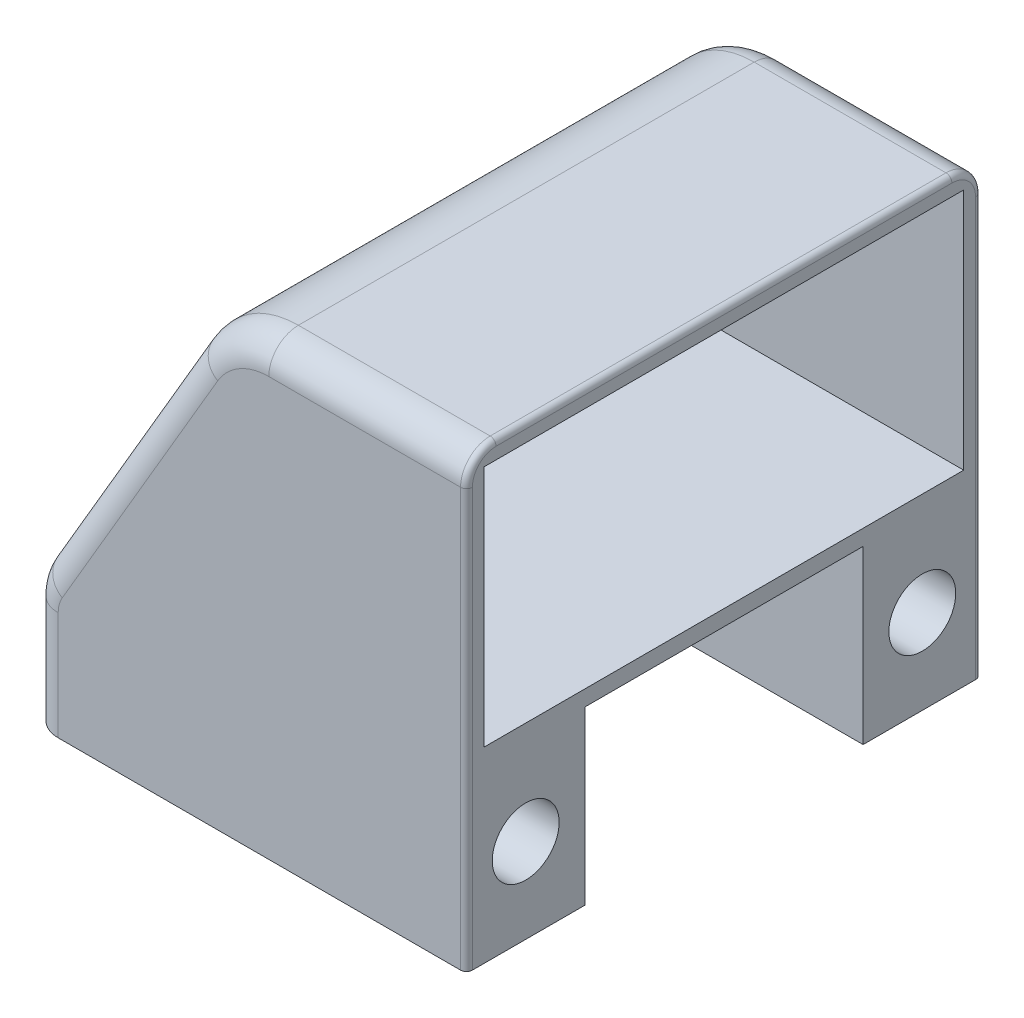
ISO-10303-21;
HEADER;
FILE_DESCRIPTION(('STEP AP214'),'2;1');
FILE_NAME('part.step','',(''),(''),'','','');
FILE_SCHEMA(('AUTOMOTIVE_DESIGN { 1 0 10303 214 1 1 1 1 }'));
ENDSEC;
DATA;
#1=APPLICATION_CONTEXT('core data for automotive mechanical design processes');
#2=APPLICATION_PROTOCOL_DEFINITION('international standard','automotive_design',2000,#1);
#3=PRODUCT_CONTEXT('',#1,'mechanical');
#4=PRODUCT('Part','Part','',(#3));
#5=PRODUCT_RELATED_PRODUCT_CATEGORY('part','',(#4));
#6=PRODUCT_DEFINITION_FORMATION('','',#4);
#7=PRODUCT_DEFINITION_CONTEXT('part definition',#1,'design');
#8=PRODUCT_DEFINITION('design','',#6,#7);
#9=PRODUCT_DEFINITION_SHAPE('','',#8);
#10=(LENGTH_UNIT() NAMED_UNIT(*) SI_UNIT(.MILLI.,.METRE.));
#11=(NAMED_UNIT(*) PLANE_ANGLE_UNIT() SI_UNIT($,.RADIAN.));
#12=(NAMED_UNIT(*) SI_UNIT($,.STERADIAN.) SOLID_ANGLE_UNIT());
#13=UNCERTAINTY_MEASURE_WITH_UNIT(LENGTH_MEASURE(1.E-05),#10,'distance_accuracy_value','');
#14=(GEOMETRIC_REPRESENTATION_CONTEXT(3) GLOBAL_UNCERTAINTY_ASSIGNED_CONTEXT((#13)) GLOBAL_UNIT_ASSIGNED_CONTEXT((#10,
#11,#12)) REPRESENTATION_CONTEXT('',''));
#15=CARTESIAN_POINT('',(0.,0.,0.));
#16=DIRECTION('',(0.,0.,1.));
#17=DIRECTION('',(1.,0.,0.));
#18=AXIS2_PLACEMENT_3D('',#15,#16,#17);
#19=CARTESIAN_POINT('',(0.,0.,87.));
#20=DIRECTION('',(-1.,0.,0.));
#21=DIRECTION('',(0.,0.,1.));
#22=AXIS2_PLACEMENT_3D('',#19,#20,#21);
#23=PLANE('',#22);
#24=CARTESIAN_POINT('',(0.,-14.33,10.));
#25=DIRECTION('',(1.,0.,0.));
#26=DIRECTION('',(0.,0.,-1.));
#27=AXIS2_PLACEMENT_3D('',#24,#25,#26);
#28=CIRCLE('',#27,5.65);
#29=CARTESIAN_POINT('',(0.,-14.33,4.35));
#30=VERTEX_POINT('',#29);
#31=EDGE_CURVE('E385',#30,#30,#28,.T.);
#32=ORIENTED_EDGE('',*,*,#31,.F.);
#33=EDGE_LOOP('',(#32));
#34=FACE_BOUND('',#33,.T.);
#35=CARTESIAN_POINT('',(0.,-14.33,77.));
#36=DIRECTION('',(1.,0.,0.));
#37=DIRECTION('',(0.,0.,-1.));
#38=AXIS2_PLACEMENT_3D('',#35,#36,#37);
#39=CIRCLE('',#38,5.65000000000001);
#40=CARTESIAN_POINT('',(0.,-14.33,71.35));
#41=VERTEX_POINT('',#40);
#42=EDGE_CURVE('E245',#41,#41,#39,.T.);
#43=ORIENTED_EDGE('',*,*,#42,.F.);
#44=EDGE_LOOP('',(#43));
#45=FACE_BOUND('',#44,.T.);
#46=DIRECTION('',(0.,0.,1.));
#47=VECTOR('',#46,1.);
#48=CARTESIAN_POINT('',(0.,-28.65,-79.3301992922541));
#49=LINE('',#48,#47);
#50=CARTESIAN_POINT('',(0.,-28.65,1.));
#51=VERTEX_POINT('',#50);
#52=CARTESIAN_POINT('',(0.,-28.65,20.));
#53=VERTEX_POINT('',#52);
#54=EDGE_CURVE('E276',#51,#53,#49,.T.);
#55=ORIENTED_EDGE('',*,*,#54,.F.);
#56=DIRECTION('',(0.,1.,0.));
#57=VECTOR('',#56,1.);
#58=CARTESIAN_POINT('',(0.,0.,1.));
#59=LINE('',#58,#57);
#60=CARTESIAN_POINT('',(0.,42.,1.));
#61=VERTEX_POINT('',#60);
#62=EDGE_CURVE('E413',#51,#61,#59,.T.);
#63=ORIENTED_EDGE('',*,*,#62,.T.);
#64=CARTESIAN_POINT('',(0.,42.,5.));
#65=DIRECTION('',(-1.,0.,0.));
#66=DIRECTION('',(0.,0.,1.));
#67=AXIS2_PLACEMENT_3D('',#64,#65,#66);
#68=CIRCLE('',#67,4.);
#69=CARTESIAN_POINT('',(0.,46.,5.));
#70=VERTEX_POINT('',#69);
#71=EDGE_CURVE('E411',#61,#70,#68,.F.);
#72=ORIENTED_EDGE('',*,*,#71,.T.);
#73=DIRECTION('',(0.,0.,-1.));
#74=VECTOR('',#73,1.);
#75=CARTESIAN_POINT('',(0.,46.,87.));
#76=LINE('',#75,#74);
#77=CARTESIAN_POINT('',(0.,46.,82.));
#78=VERTEX_POINT('',#77);
#79=EDGE_CURVE('E409',#70,#78,#76,.F.);
#80=ORIENTED_EDGE('',*,*,#79,.T.);
#81=CARTESIAN_POINT('',(0.,42.,82.));
#82=DIRECTION('',(-1.,0.,0.));
#83=DIRECTION('',(0.,0.,1.));
#84=AXIS2_PLACEMENT_3D('',#81,#82,#83);
#85=CIRCLE('',#84,4.);
#86=CARTESIAN_POINT('',(0.,42.,86.));
#87=VERTEX_POINT('',#86);
#88=EDGE_CURVE('E407',#78,#87,#85,.F.);
#89=ORIENTED_EDGE('',*,*,#88,.T.);
#90=DIRECTION('',(0.,1.,0.));
#91=VECTOR('',#90,1.);
#92=CARTESIAN_POINT('',(0.,-28.65,86.));
#93=LINE('',#92,#91);
#94=CARTESIAN_POINT('',(0.,-28.65,86.));
#95=VERTEX_POINT('',#94);
#96=EDGE_CURVE('E405',#87,#95,#93,.F.);
#97=ORIENTED_EDGE('',*,*,#96,.T.);
#98=CARTESIAN_POINT('',(0.,-28.65,67.));
#99=VERTEX_POINT('',#98);
#100=EDGE_CURVE('E280',#99,#95,#49,.T.);
#101=ORIENTED_EDGE('',*,*,#100,.F.);
#102=DIRECTION('',(0.,-1.,0.));
#103=VECTOR('',#102,1.);
#104=CARTESIAN_POINT('',(0.,-28.65,67.));
#105=LINE('',#104,#103);
#106=CARTESIAN_POINT('',(0.,0.35,67.));
#107=VERTEX_POINT('',#106);
#108=EDGE_CURVE('E253',#107,#99,#105,.T.);
#109=ORIENTED_EDGE('',*,*,#108,.F.);
#110=DIRECTION('',(0.,0.,1.));
#111=VECTOR('',#110,1.);
#112=CARTESIAN_POINT('',(0.,0.35,67.));
#113=LINE('',#112,#111);
#114=CARTESIAN_POINT('',(0.,0.35,20.));
#115=VERTEX_POINT('',#114);
#116=EDGE_CURVE('E258',#115,#107,#113,.T.);
#117=ORIENTED_EDGE('',*,*,#116,.F.);
#118=DIRECTION('',(0.,1.,0.));
#119=VECTOR('',#118,1.);
#120=CARTESIAN_POINT('',(0.,-28.65,20.));
#121=LINE('',#120,#119);
#122=EDGE_CURVE('E221',#53,#115,#121,.T.);
#123=ORIENTED_EDGE('',*,*,#122,.F.);
#124=EDGE_LOOP('',(#55,#63,#72,#80,#89,#97,#101,#109,#117,#123));
#125=FACE_BOUND('',#124,.T.);
#126=DIRECTION('',(0.,1.,0.));
#127=VECTOR('',#126,1.);
#128=CARTESIAN_POINT('',(0.,0.,3.));
#129=LINE('',#128,#127);
#130=CARTESIAN_POINT('',(0.,3.,3.));
#131=VERTEX_POINT('',#130);
#132=CARTESIAN_POINT('',(0.,44.,3.));
#133=VERTEX_POINT('',#132);
#134=EDGE_CURVE('E275',#131,#133,#129,.T.);
#135=ORIENTED_EDGE('',*,*,#134,.F.);
#136=DIRECTION('',(0.,0.,-1.));
#137=VECTOR('',#136,1.);
#138=CARTESIAN_POINT('',(0.,3.,87.));
#139=LINE('',#138,#137);
#140=CARTESIAN_POINT('',(0.,3.,84.));
#141=VERTEX_POINT('',#140);
#142=EDGE_CURVE('E298',#141,#131,#139,.T.);
#143=ORIENTED_EDGE('',*,*,#142,.F.);
#144=DIRECTION('',(0.,1.,0.));
#145=VECTOR('',#144,1.);
#146=CARTESIAN_POINT('',(0.,0.,84.));
#147=LINE('',#146,#145);
#148=CARTESIAN_POINT('',(0.,44.,84.));
#149=VERTEX_POINT('',#148);
#150=EDGE_CURVE('E291',#141,#149,#147,.T.);
#151=ORIENTED_EDGE('',*,*,#150,.T.);
#152=DIRECTION('',(0.,0.,-1.));
#153=VECTOR('',#152,1.);
#154=CARTESIAN_POINT('',(0.,44.,87.));
#155=LINE('',#154,#153);
#156=EDGE_CURVE('E297',#149,#133,#155,.T.);
#157=ORIENTED_EDGE('',*,*,#156,.T.);
#158=EDGE_LOOP('',(#135,#143,#151,#157));
#159=FACE_BOUND('',#158,.T.);
#160=ADVANCED_FACE('F33',(#34,#45,#125,#159),#23,.F.);
#161=CARTESIAN_POINT('',(0.,47.,87.));
#162=DIRECTION('',(0.,-1.,0.));
#163=DIRECTION('',(1.,0.,0.));
#164=AXIS2_PLACEMENT_3D('',#161,#162,#163);
#165=PLANE('',#164);
#166=DIRECTION('',(-1.,0.,0.));
#167=VECTOR('',#166,1.);
#168=CARTESIAN_POINT('',(0.,47.,82.));
#169=LINE('',#168,#167);
#170=CARTESIAN_POINT('',(-33.3976247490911,47.,82.));
#171=VERTEX_POINT('',#170);
#172=CARTESIAN_POINT('',(-1.,47.,82.));
#173=VERTEX_POINT('',#172);
#174=EDGE_CURVE('E324',#171,#173,#169,.F.);
#175=ORIENTED_EDGE('',*,*,#174,.T.);
#176=DIRECTION('',(0.,0.,-1.));
#177=VECTOR('',#176,1.);
#178=CARTESIAN_POINT('',(-1.,47.,87.));
#179=LINE('',#178,#177);
#180=CARTESIAN_POINT('',(-1.,47.,5.));
#181=VERTEX_POINT('',#180);
#182=EDGE_CURVE('E424',#173,#181,#179,.T.);
#183=ORIENTED_EDGE('',*,*,#182,.T.);
#184=DIRECTION('',(-1.,0.,0.));
#185=VECTOR('',#184,1.);
#186=CARTESIAN_POINT('',(0.,47.,5.));
#187=LINE('',#186,#185);
#188=CARTESIAN_POINT('',(-33.3976247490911,47.,4.99999999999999));
#189=VERTEX_POINT('',#188);
#190=EDGE_CURVE('E326',#181,#189,#187,.T.);
#191=ORIENTED_EDGE('',*,*,#190,.T.);
#192=DIRECTION('',(0.,0.,-1.));
#193=VECTOR('',#192,1.);
#194=CARTESIAN_POINT('',(-33.3976247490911,47.,87.));
#195=LINE('',#194,#193);
#196=EDGE_CURVE('E315',#189,#171,#195,.F.);
#197=ORIENTED_EDGE('',*,*,#196,.T.);
#198=EDGE_LOOP('',(#175,#183,#191,#197));
#199=FACE_BOUND('',#198,.T.);
#200=ADVANCED_FACE('F492',(#199),#165,.F.);
#201=CARTESIAN_POINT('',(-42.,47.,87.));
#202=DIRECTION('',(0.863112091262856,-0.505012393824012,0.));
#203=DIRECTION('',(0.505012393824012,0.863112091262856,0.));
#204=AXIS2_PLACEMENT_3D('',#201,#202,#203);
#205=PLANE('',#204);
#206=DIRECTION('',(0.,0.,-1.));
#207=VECTOR('',#206,1.);
#208=CARTESIAN_POINT('',(-46.3443061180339,39.5751859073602,87.));
#209=LINE('',#208,#207);
#210=CARTESIAN_POINT('',(-46.3443061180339,39.5751859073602,82.));
#211=VERTEX_POINT('',#210);
#212=CARTESIAN_POINT('',(-46.3443061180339,39.5751859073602,5.));
#213=VERTEX_POINT('',#212);
#214=EDGE_CURVE('E306',#211,#213,#209,.T.);
#215=ORIENTED_EDGE('',*,*,#214,.T.);
#216=DIRECTION('',(-0.505012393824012,-0.863112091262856,0.));
#217=VECTOR('',#216,1.);
#218=CARTESIAN_POINT('',(-42.,47.,5.));
#219=LINE('',#218,#217);
#220=CARTESIAN_POINT('',(-72.6071847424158,-5.31046119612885,5.));
#221=VERTEX_POINT('',#220);
#222=EDGE_CURVE('E345',#213,#221,#219,.T.);
#223=ORIENTED_EDGE('',*,*,#222,.T.);
#224=DIRECTION('',(0.,0.,1.));
#225=VECTOR('',#224,1.);
#226=CARTESIAN_POINT('',(-72.6071847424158,-5.31046119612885,87.));
#227=LINE('',#226,#225);
#228=CARTESIAN_POINT('',(-72.6071847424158,-5.31046119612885,82.));
#229=VERTEX_POINT('',#228);
#230=EDGE_CURVE('E318',#221,#229,#227,.T.);
#231=ORIENTED_EDGE('',*,*,#230,.T.);
#232=DIRECTION('',(-0.505012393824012,-0.863112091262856,0.));
#233=VECTOR('',#232,1.);
#234=CARTESIAN_POINT('',(-46.3443061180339,39.5751859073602,82.));
#235=LINE('',#234,#233);
#236=EDGE_CURVE('E343',#229,#211,#235,.F.);
#237=ORIENTED_EDGE('',*,*,#236,.T.);
#238=EDGE_LOOP('',(#215,#223,#231,#237));
#239=FACE_BOUND('',#238,.T.);
#240=ADVANCED_FACE('F534',(#239),#205,.F.);
#241=CARTESIAN_POINT('',(0.,47.,87.));
#242=DIRECTION('',(0.,0.,1.));
#243=DIRECTION('',(1.,0.,0.));
#244=AXIS2_PLACEMENT_3D('',#241,#242,#243);
#245=PLANE('',#244);
#246=DIRECTION('',(1.,0.,0.));
#247=VECTOR('',#246,1.);
#248=CARTESIAN_POINT('',(0.,-28.65,87.));
#249=LINE('',#248,#247);
#250=CARTESIAN_POINT('',(-68.9760638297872,-28.65,87.));
#251=VERTEX_POINT('',#250);
#252=CARTESIAN_POINT('',(-1.,-28.65,87.));
#253=VERTEX_POINT('',#252);
#254=EDGE_CURVE('E268',#251,#253,#249,.T.);
#255=ORIENTED_EDGE('',*,*,#254,.T.);
#256=DIRECTION('',(0.,1.,0.));
#257=VECTOR('',#256,1.);
#258=CARTESIAN_POINT('',(-1.,42.,87.));
#259=LINE('',#258,#257);
#260=CARTESIAN_POINT('',(-1.,42.,87.));
#261=VERTEX_POINT('',#260);
#262=EDGE_CURVE('E11',#253,#261,#259,.T.);
#263=ORIENTED_EDGE('',*,*,#262,.T.);
#264=DIRECTION('',(-1.,0.,0.));
#265=VECTOR('',#264,1.);
#266=CARTESIAN_POINT('',(-33.3976247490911,42.,87.));
#267=LINE('',#266,#265);
#268=CARTESIAN_POINT('',(-33.3976247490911,42.,87.));
#269=VERTEX_POINT('',#268);
#270=EDGE_CURVE('E360',#261,#269,#267,.T.);
#271=ORIENTED_EDGE('',*,*,#270,.T.);
#272=CARTESIAN_POINT('',(-33.3976247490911,32.,87.));
#273=DIRECTION('',(0.,0.,1.));
#274=DIRECTION('',(1.,0.,0.));
#275=AXIS2_PLACEMENT_3D('',#272,#273,#274);
#276=CIRCLE('',#275,10.);
#277=CARTESIAN_POINT('',(-42.0287456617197,37.0501239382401,87.));
#278=VERTEX_POINT('',#277);
#279=EDGE_CURVE('E362',#269,#278,#276,.T.);
#280=ORIENTED_EDGE('',*,*,#279,.T.);
#281=DIRECTION('',(-0.505012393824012,-0.863112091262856,0.));
#282=VECTOR('',#281,1.);
#283=CARTESIAN_POINT('',(-68.2916242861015,-7.83552316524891,87.));
#284=LINE('',#283,#282);
#285=CARTESIAN_POINT('',(-68.2916242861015,-7.83552316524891,87.));
#286=VERTEX_POINT('',#285);
#287=EDGE_CURVE('E364',#278,#286,#284,.T.);
#288=ORIENTED_EDGE('',*,*,#287,.T.);
#289=CARTESIAN_POINT('',(-63.9760638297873,-10.360585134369,87.));
#290=DIRECTION('',(0.,0.,1.));
#291=DIRECTION('',(1.,0.,0.));
#292=AXIS2_PLACEMENT_3D('',#289,#290,#291);
#293=CIRCLE('',#292,5.);
#294=CARTESIAN_POINT('',(-68.9760638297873,-10.360585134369,87.));
#295=VERTEX_POINT('',#294);
#296=EDGE_CURVE('E366',#286,#295,#293,.T.);
#297=ORIENTED_EDGE('',*,*,#296,.T.);
#298=DIRECTION('',(0.,-1.,0.));
#299=VECTOR('',#298,1.);
#300=CARTESIAN_POINT('',(-68.9760638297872,47.,87.));
#301=LINE('',#300,#299);
#302=EDGE_CURVE('E368',#295,#251,#301,.T.);
#303=ORIENTED_EDGE('',*,*,#302,.T.);
#304=EDGE_LOOP('',(#255,#263,#271,#280,#288,#297,#303));
#305=FACE_BOUND('',#304,.T.);
#306=ADVANCED_FACE('F500',(#305),#245,.T.);
#307=CARTESIAN_POINT('',(0.,47.,0.));
#308=DIRECTION('',(0.,0.,1.));
#309=DIRECTION('',(1.,0.,0.));
#310=AXIS2_PLACEMENT_3D('',#307,#308,#309);
#311=PLANE('',#310);
#312=DIRECTION('',(-1.,0.,0.));
#313=VECTOR('',#312,1.);
#314=CARTESIAN_POINT('',(0.,42.,0.));
#315=LINE('',#314,#313);
#316=CARTESIAN_POINT('',(-33.3976247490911,42.,0.));
#317=VERTEX_POINT('',#316);
#318=CARTESIAN_POINT('',(-1.,42.,0.));
#319=VERTEX_POINT('',#318);
#320=EDGE_CURVE('E336',#317,#319,#315,.F.);
#321=ORIENTED_EDGE('',*,*,#320,.T.);
#322=DIRECTION('',(0.,1.,0.));
#323=VECTOR('',#322,1.);
#324=CARTESIAN_POINT('',(-1.,47.,0.));
#325=LINE('',#324,#323);
#326=CARTESIAN_POINT('',(-1.,-28.65,0.));
#327=VERTEX_POINT('',#326);
#328=EDGE_CURVE('E416',#319,#327,#325,.F.);
#329=ORIENTED_EDGE('',*,*,#328,.T.);
#330=DIRECTION('',(-1.,0.,0.));
#331=VECTOR('',#330,1.);
#332=CARTESIAN_POINT('',(0.,-28.65,0.));
#333=LINE('',#332,#331);
#334=CARTESIAN_POINT('',(-68.9760638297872,-28.65,0.));
#335=VERTEX_POINT('',#334);
#336=EDGE_CURVE('E273',#327,#335,#333,.T.);
#337=ORIENTED_EDGE('',*,*,#336,.T.);
#338=DIRECTION('',(0.,1.,0.));
#339=VECTOR('',#338,1.);
#340=CARTESIAN_POINT('',(-68.9760638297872,-10.360585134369,0.));
#341=LINE('',#340,#339);
#342=CARTESIAN_POINT('',(-68.9760638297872,-10.360585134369,0.));
#343=VERTEX_POINT('',#342);
#344=EDGE_CURVE('E328',#335,#343,#341,.T.);
#345=ORIENTED_EDGE('',*,*,#344,.T.);
#346=CARTESIAN_POINT('',(-63.9760638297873,-10.360585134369,0.));
#347=DIRECTION('',(0.,0.,1.));
#348=DIRECTION('',(1.,0.,0.));
#349=AXIS2_PLACEMENT_3D('',#346,#347,#348);
#350=CIRCLE('',#349,5.);
#351=CARTESIAN_POINT('',(-68.2916242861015,-7.8355231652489,0.));
#352=VERTEX_POINT('',#351);
#353=EDGE_CURVE('E330',#343,#352,#350,.F.);
#354=ORIENTED_EDGE('',*,*,#353,.T.);
#355=DIRECTION('',(-0.505012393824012,-0.863112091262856,0.));
#356=VECTOR('',#355,1.);
#357=CARTESIAN_POINT('',(-26.9728637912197,62.7819947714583,0.));
#358=LINE('',#357,#356);
#359=CARTESIAN_POINT('',(-42.0287456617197,37.0501239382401,0.));
#360=VERTEX_POINT('',#359);
#361=EDGE_CURVE('E332',#352,#360,#358,.F.);
#362=ORIENTED_EDGE('',*,*,#361,.T.);
#363=CARTESIAN_POINT('',(-33.3976247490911,32.,0.));
#364=DIRECTION('',(0.,0.,1.));
#365=DIRECTION('',(1.,0.,0.));
#366=AXIS2_PLACEMENT_3D('',#363,#364,#365);
#367=CIRCLE('',#366,10.);
#368=EDGE_CURVE('E334',#360,#317,#367,.F.);
#369=ORIENTED_EDGE('',*,*,#368,.T.);
#370=EDGE_LOOP('',(#321,#329,#337,#345,#354,#362,#369));
#371=FACE_BOUND('',#370,.T.);
#372=ADVANCED_FACE('F479',(#371),#311,.F.);
#373=CARTESIAN_POINT('',(0.,44.,87.));
#374=DIRECTION('',(0.,-1.,0.));
#375=DIRECTION('',(1.,0.,0.));
#376=AXIS2_PLACEMENT_3D('',#373,#374,#375);
#377=PLANE('',#376);
#378=DIRECTION('',(-1.,0.,0.));
#379=VECTOR('',#378,1.);
#380=CARTESIAN_POINT('',(0.,44.,84.));
#381=LINE('',#380,#379);
#382=CARTESIAN_POINT('',(-34.544608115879,44.,84.));
#383=VERTEX_POINT('',#382);
#384=EDGE_CURVE('E287',#149,#383,#381,.T.);
#385=ORIENTED_EDGE('',*,*,#384,.T.);
#386=DIRECTION('',(0.,0.,-1.));
#387=VECTOR('',#386,1.);
#388=CARTESIAN_POINT('',(-34.544608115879,44.,3.00000000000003));
#389=LINE('',#388,#387);
#390=CARTESIAN_POINT('',(-34.544608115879,44.,3.));
#391=VERTEX_POINT('',#390);
#392=EDGE_CURVE('E371',#383,#391,#389,.T.);
#393=ORIENTED_EDGE('',*,*,#392,.T.);
#394=DIRECTION('',(-1.,0.,0.));
#395=VECTOR('',#394,1.);
#396=CARTESIAN_POINT('',(0.,44.,3.));
#397=LINE('',#396,#395);
#398=EDGE_CURVE('E283',#133,#391,#397,.T.);
#399=ORIENTED_EDGE('',*,*,#398,.F.);
#400=ORIENTED_EDGE('',*,*,#156,.F.);
#401=EDGE_LOOP('',(#385,#393,#399,#400));
#402=FACE_BOUND('',#401,.T.);
#403=ADVANCED_FACE('F561',(#402),#377,.T.);
#404=CARTESIAN_POINT('',(-39.4106637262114,45.484962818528,87.));
#405=DIRECTION('',(0.863112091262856,-0.505012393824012,0.));
#406=DIRECTION('',(0.505012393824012,0.863112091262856,0.));
#407=AXIS2_PLACEMENT_3D('',#404,#405,#406);
#408=PLANE('',#407);
#409=DIRECTION('',(-0.505012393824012,-0.863112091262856,0.));
#410=VECTOR('',#409,1.);
#411=CARTESIAN_POINT('',(-39.4106637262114,45.484962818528,3.));
#412=LINE('',#411,#410);
#413=CARTESIAN_POINT('',(-43.1757290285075,39.0501239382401,3.));
#414=VERTEX_POINT('',#413);
#415=CARTESIAN_POINT('',(-64.2688866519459,2.99999999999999,3.));
#416=VERTEX_POINT('',#415);
#417=EDGE_CURVE('E286',#414,#416,#412,.T.);
#418=ORIENTED_EDGE('',*,*,#417,.F.);
#419=DIRECTION('',(0.,0.,-1.));
#420=VECTOR('',#419,1.);
#421=CARTESIAN_POINT('',(-43.1757290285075,39.0501239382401,84.));
#422=LINE('',#421,#420);
#423=CARTESIAN_POINT('',(-43.1757290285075,39.0501239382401,84.));
#424=VERTEX_POINT('',#423);
#425=EDGE_CURVE('E401',#414,#424,#422,.F.);
#426=ORIENTED_EDGE('',*,*,#425,.T.);
#427=DIRECTION('',(-0.505012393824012,-0.863112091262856,0.));
#428=VECTOR('',#427,1.);
#429=CARTESIAN_POINT('',(-39.4106637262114,45.484962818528,84.));
#430=LINE('',#429,#428);
#431=CARTESIAN_POINT('',(-64.2688866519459,2.99999999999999,84.));
#432=VERTEX_POINT('',#431);
#433=EDGE_CURVE('E290',#424,#432,#430,.T.);
#434=ORIENTED_EDGE('',*,*,#433,.T.);
#435=DIRECTION('',(0.,0.,-1.));
#436=VECTOR('',#435,1.);
#437=CARTESIAN_POINT('',(-64.2688866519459,2.99999999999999,87.));
#438=LINE('',#437,#436);
#439=EDGE_CURVE('E294',#432,#416,#438,.T.);
#440=ORIENTED_EDGE('',*,*,#439,.T.);
#441=EDGE_LOOP('',(#418,#426,#434,#440));
#442=FACE_BOUND('',#441,.T.);
#443=ADVANCED_FACE('F575',(#442),#408,.T.);
#444=CARTESIAN_POINT('',(0.,3.,87.));
#445=DIRECTION('',(0.,1.,0.));
#446=DIRECTION('',(-1.,0.,0.));
#447=AXIS2_PLACEMENT_3D('',#444,#445,#446);
#448=PLANE('',#447);
#449=DIRECTION('',(1.,0.,0.));
#450=VECTOR('',#449,1.);
#451=CARTESIAN_POINT('',(0.,3.,3.));
#452=LINE('',#451,#450);
#453=EDGE_CURVE('E293',#416,#131,#452,.T.);
#454=ORIENTED_EDGE('',*,*,#453,.F.);
#455=ORIENTED_EDGE('',*,*,#439,.F.);
#456=DIRECTION('',(1.,0.,0.));
#457=VECTOR('',#456,1.);
#458=CARTESIAN_POINT('',(0.,3.,84.));
#459=LINE('',#458,#457);
#460=EDGE_CURVE('E300',#432,#141,#459,.T.);
#461=ORIENTED_EDGE('',*,*,#460,.T.);
#462=ORIENTED_EDGE('',*,*,#142,.T.);
#463=EDGE_LOOP('',(#454,#455,#461,#462));
#464=FACE_BOUND('',#463,.T.);
#465=ADVANCED_FACE('F571',(#464),#448,.T.);
#466=CARTESIAN_POINT('',(0.,47.,84.));
#467=DIRECTION('',(0.,0.,1.));
#468=DIRECTION('',(1.,0.,0.));
#469=AXIS2_PLACEMENT_3D('',#466,#467,#468);
#470=PLANE('',#469);
#471=ORIENTED_EDGE('',*,*,#433,.F.);
#472=CARTESIAN_POINT('',(-34.544608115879,34.,84.));
#473=DIRECTION('',(0.,0.,1.));
#474=DIRECTION('',(1.,0.,0.));
#475=AXIS2_PLACEMENT_3D('',#472,#473,#474);
#476=CIRCLE('',#475,10.);
#477=EDGE_CURVE('E403',#424,#383,#476,.F.);
#478=ORIENTED_EDGE('',*,*,#477,.T.);
#479=ORIENTED_EDGE('',*,*,#384,.F.);
#480=ORIENTED_EDGE('',*,*,#150,.F.);
#481=ORIENTED_EDGE('',*,*,#460,.F.);
#482=EDGE_LOOP('',(#471,#478,#479,#480,#481));
#483=FACE_BOUND('',#482,.T.);
#484=ADVANCED_FACE('F567',(#483),#470,.F.);
#485=CARTESIAN_POINT('',(0.,47.,3.));
#486=DIRECTION('',(0.,0.,1.));
#487=DIRECTION('',(1.,0.,0.));
#488=AXIS2_PLACEMENT_3D('',#485,#486,#487);
#489=PLANE('',#488);
#490=ORIENTED_EDGE('',*,*,#398,.T.);
#491=CARTESIAN_POINT('',(-34.544608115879,34.,3.));
#492=DIRECTION('',(0.,0.,1.));
#493=DIRECTION('',(1.,0.,0.));
#494=AXIS2_PLACEMENT_3D('',#491,#492,#493);
#495=CIRCLE('',#494,10.);
#496=EDGE_CURVE('E399',#391,#414,#495,.T.);
#497=ORIENTED_EDGE('',*,*,#496,.T.);
#498=ORIENTED_EDGE('',*,*,#417,.T.);
#499=ORIENTED_EDGE('',*,*,#453,.T.);
#500=ORIENTED_EDGE('',*,*,#134,.T.);
#501=EDGE_LOOP('',(#490,#497,#498,#499,#500));
#502=FACE_BOUND('',#501,.T.);
#503=ADVANCED_FACE('F564',(#502),#489,.T.);
#504=CARTESIAN_POINT('',(0.,-28.65,-79.3301992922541));
#505=DIRECTION('',(0.,-1.,0.));
#506=DIRECTION('',(1.,0.,0.));
#507=AXIS2_PLACEMENT_3D('',#504,#505,#506);
#508=PLANE('',#507);
#509=ORIENTED_EDGE('',*,*,#336,.F.);
#510=CARTESIAN_POINT('',(-1.,-28.65,1.));
#511=DIRECTION('',(0.,-1.,0.));
#512=DIRECTION('',(1.,0.,0.));
#513=AXIS2_PLACEMENT_3D('',#510,#511,#512);
#514=CIRCLE('',#513,1.);
#515=EDGE_CURVE('E420',#327,#51,#514,.T.);
#516=ORIENTED_EDGE('',*,*,#515,.T.);
#517=ORIENTED_EDGE('',*,*,#54,.T.);
#518=DIRECTION('',(1.,0.,0.));
#519=VECTOR('',#518,1.);
#520=CARTESIAN_POINT('',(-49.5,-28.65,20.));
#521=LINE('',#520,#519);
#522=CARTESIAN_POINT('',(-49.5,-28.65,20.));
#523=VERTEX_POINT('',#522);
#524=EDGE_CURVE('E226',#523,#53,#521,.T.);
#525=ORIENTED_EDGE('',*,*,#524,.F.);
#526=DIRECTION('',(0.,0.,-1.));
#527=VECTOR('',#526,1.);
#528=CARTESIAN_POINT('',(-49.5,-28.65,67.));
#529=LINE('',#528,#527);
#530=CARTESIAN_POINT('',(-49.5,-28.65,67.));
#531=VERTEX_POINT('',#530);
#532=EDGE_CURVE('E257',#531,#523,#529,.T.);
#533=ORIENTED_EDGE('',*,*,#532,.F.);
#534=DIRECTION('',(1.,0.,0.));
#535=VECTOR('',#534,1.);
#536=CARTESIAN_POINT('',(-49.5,-28.65,67.));
#537=LINE('',#536,#535);
#538=EDGE_CURVE('E264',#531,#99,#537,.T.);
#539=ORIENTED_EDGE('',*,*,#538,.T.);
#540=ORIENTED_EDGE('',*,*,#100,.T.);
#541=CARTESIAN_POINT('',(-1.,-28.65,86.));
#542=DIRECTION('',(0.,-1.,0.));
#543=DIRECTION('',(1.,0.,0.));
#544=AXIS2_PLACEMENT_3D('',#541,#542,#543);
#545=CIRCLE('',#544,1.);
#546=EDGE_CURVE('E418',#95,#253,#545,.T.);
#547=ORIENTED_EDGE('',*,*,#546,.T.);
#548=ORIENTED_EDGE('',*,*,#254,.F.);
#549=CARTESIAN_POINT('',(-68.9760638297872,-28.65,82.));
#550=DIRECTION('',(0.,-1.,0.));
#551=DIRECTION('',(1.,0.,0.));
#552=AXIS2_PLACEMENT_3D('',#549,#550,#551);
#553=CIRCLE('',#552,5.);
#554=CARTESIAN_POINT('',(-73.9760638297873,-28.65,82.));
#555=VERTEX_POINT('',#554);
#556=EDGE_CURVE('E355',#251,#555,#553,.T.);
#557=ORIENTED_EDGE('',*,*,#556,.T.);
#558=DIRECTION('',(0.,0.,1.));
#559=VECTOR('',#558,1.);
#560=CARTESIAN_POINT('',(-73.9760638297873,-28.65,-79.3301992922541));
#561=LINE('',#560,#559);
#562=CARTESIAN_POINT('',(-73.9760638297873,-28.65,5.));
#563=VERTEX_POINT('',#562);
#564=EDGE_CURVE('E278',#563,#555,#561,.T.);
#565=ORIENTED_EDGE('',*,*,#564,.F.);
#566=CARTESIAN_POINT('',(-68.9760638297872,-28.65,5.));
#567=DIRECTION('',(0.,-1.,0.));
#568=DIRECTION('',(1.,0.,0.));
#569=AXIS2_PLACEMENT_3D('',#566,#567,#568);
#570=CIRCLE('',#569,5.);
#571=EDGE_CURVE('E357',#563,#335,#570,.T.);
#572=ORIENTED_EDGE('',*,*,#571,.T.);
#573=EDGE_LOOP('',(#509,#516,#517,#525,#533,#539,#540,#547,#548,#557,#565,#572));
#574=FACE_BOUND('',#573,.T.);
#575=ADVANCED_FACE('F453',(#574),#508,.T.);
#576=CARTESIAN_POINT('',(-73.9760638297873,-28.65,-79.3301992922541));
#577=DIRECTION('',(-1.,0.,0.));
#578=DIRECTION('',(0.,0.,1.));
#579=AXIS2_PLACEMENT_3D('',#576,#577,#578);
#580=PLANE('',#579);
#581=DIRECTION('',(0.,0.,1.));
#582=VECTOR('',#581,1.);
#583=CARTESIAN_POINT('',(-73.9760638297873,-10.360585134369,0.));
#584=LINE('',#583,#582);
#585=CARTESIAN_POINT('',(-73.9760638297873,-10.360585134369,82.));
#586=VERTEX_POINT('',#585);
#587=CARTESIAN_POINT('',(-73.9760638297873,-10.360585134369,5.));
#588=VERTEX_POINT('',#587);
#589=EDGE_CURVE('E321',#586,#588,#584,.F.);
#590=ORIENTED_EDGE('',*,*,#589,.T.);
#591=DIRECTION('',(0.,1.,0.));
#592=VECTOR('',#591,1.);
#593=CARTESIAN_POINT('',(-73.9760638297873,-28.65,5.));
#594=LINE('',#593,#592);
#595=EDGE_CURVE('E353',#588,#563,#594,.F.);
#596=ORIENTED_EDGE('',*,*,#595,.T.);
#597=ORIENTED_EDGE('',*,*,#564,.T.);
#598=DIRECTION('',(0.,-1.,0.));
#599=VECTOR('',#598,1.);
#600=CARTESIAN_POINT('',(-73.9760638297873,-28.65,82.));
#601=LINE('',#600,#599);
#602=EDGE_CURVE('E351',#555,#586,#601,.F.);
#603=ORIENTED_EDGE('',*,*,#602,.T.);
#604=EDGE_LOOP('',(#590,#596,#597,#603));
#605=FACE_BOUND('',#604,.T.);
#606=ADVANCED_FACE('F517',(#605),#580,.T.);
#607=CARTESIAN_POINT('',(-49.5,-28.65,67.));
#608=DIRECTION('',(0.,0.,1.));
#609=DIRECTION('',(1.,0.,0.));
#610=AXIS2_PLACEMENT_3D('',#607,#608,#609);
#611=PLANE('',#610);
#612=ORIENTED_EDGE('',*,*,#108,.T.);
#613=ORIENTED_EDGE('',*,*,#538,.F.);
#614=DIRECTION('',(0.,-1.,0.));
#615=VECTOR('',#614,1.);
#616=CARTESIAN_POINT('',(-49.5,-28.65,67.));
#617=LINE('',#616,#615);
#618=CARTESIAN_POINT('',(-49.5,-25.65,67.));
#619=VERTEX_POINT('',#618);
#620=EDGE_CURVE('E255',#619,#531,#617,.T.);
#621=ORIENTED_EDGE('',*,*,#620,.F.);
#622=DIRECTION('',(1.,0.,0.));
#623=VECTOR('',#622,1.);
#624=CARTESIAN_POINT('',(-67.,-25.65,67.));
#625=LINE('',#624,#623);
#626=CARTESIAN_POINT('',(-67.,-25.65,67.));
#627=VERTEX_POINT('',#626);
#628=EDGE_CURVE('E249',#627,#619,#625,.T.);
#629=ORIENTED_EDGE('',*,*,#628,.F.);
#630=DIRECTION('',(0.,-1.,0.));
#631=VECTOR('',#630,1.);
#632=CARTESIAN_POINT('',(-67.,0.349999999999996,67.));
#633=LINE('',#632,#631);
#634=CARTESIAN_POINT('',(-67.,0.349999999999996,67.));
#635=VERTEX_POINT('',#634);
#636=EDGE_CURVE('E234',#635,#627,#633,.T.);
#637=ORIENTED_EDGE('',*,*,#636,.F.);
#638=DIRECTION('',(1.,0.,0.));
#639=VECTOR('',#638,1.);
#640=CARTESIAN_POINT('',(-49.5,0.35,67.));
#641=LINE('',#640,#639);
#642=EDGE_CURVE('E225',#635,#107,#641,.T.);
#643=ORIENTED_EDGE('',*,*,#642,.T.);
#644=EDGE_LOOP('',(#612,#613,#621,#629,#637,#643));
#645=FACE_BOUND('',#644,.T.);
#646=ADVANCED_FACE('F460',(#645),#611,.F.);
#647=CARTESIAN_POINT('',(-49.5,0.35,67.));
#648=DIRECTION('',(0.,1.,0.));
#649=DIRECTION('',(0.,0.,1.));
#650=AXIS2_PLACEMENT_3D('',#647,#648,#649);
#651=PLANE('',#650);
#652=ORIENTED_EDGE('',*,*,#116,.T.);
#653=ORIENTED_EDGE('',*,*,#642,.F.);
#654=DIRECTION('',(0.,0.,1.));
#655=VECTOR('',#654,1.);
#656=CARTESIAN_POINT('',(-67.,0.349999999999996,20.));
#657=LINE('',#656,#655);
#658=CARTESIAN_POINT('',(-67.,0.349999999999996,20.));
#659=VERTEX_POINT('',#658);
#660=EDGE_CURVE('E229',#659,#635,#657,.T.);
#661=ORIENTED_EDGE('',*,*,#660,.F.);
#662=DIRECTION('',(1.,0.,0.));
#663=VECTOR('',#662,1.);
#664=CARTESIAN_POINT('',(-49.5,0.35,20.));
#665=LINE('',#664,#663);
#666=EDGE_CURVE('E213',#659,#115,#665,.T.);
#667=ORIENTED_EDGE('',*,*,#666,.T.);
#668=EDGE_LOOP('',(#652,#653,#661,#667));
#669=FACE_BOUND('',#668,.T.);
#670=ADVANCED_FACE('F230',(#669),#651,.F.);
#671=CARTESIAN_POINT('',(-49.5,-28.65,20.));
#672=DIRECTION('',(0.,0.,-1.));
#673=DIRECTION('',(-1.,0.,0.));
#674=AXIS2_PLACEMENT_3D('',#671,#672,#673);
#675=PLANE('',#674);
#676=ORIENTED_EDGE('',*,*,#122,.T.);
#677=ORIENTED_EDGE('',*,*,#666,.F.);
#678=DIRECTION('',(0.,1.,0.));
#679=VECTOR('',#678,1.);
#680=CARTESIAN_POINT('',(-67.,0.349999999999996,20.));
#681=LINE('',#680,#679);
#682=CARTESIAN_POINT('',(-67.,-25.65,20.));
#683=VERTEX_POINT('',#682);
#684=EDGE_CURVE('E217',#683,#659,#681,.T.);
#685=ORIENTED_EDGE('',*,*,#684,.F.);
#686=DIRECTION('',(1.,0.,0.));
#687=VECTOR('',#686,1.);
#688=CARTESIAN_POINT('',(-67.,-25.65,20.));
#689=LINE('',#688,#687);
#690=CARTESIAN_POINT('',(-49.5,-25.65,20.));
#691=VERTEX_POINT('',#690);
#692=EDGE_CURVE('E251',#683,#691,#689,.T.);
#693=ORIENTED_EDGE('',*,*,#692,.T.);
#694=DIRECTION('',(0.,1.,0.));
#695=VECTOR('',#694,1.);
#696=CARTESIAN_POINT('',(-49.5,-28.65,20.));
#697=LINE('',#696,#695);
#698=EDGE_CURVE('E261',#523,#691,#697,.T.);
#699=ORIENTED_EDGE('',*,*,#698,.F.);
#700=ORIENTED_EDGE('',*,*,#524,.T.);
#701=EDGE_LOOP('',(#676,#677,#685,#693,#699,#700));
#702=FACE_BOUND('',#701,.T.);
#703=ADVANCED_FACE('F215',(#702),#675,.F.);
#704=CARTESIAN_POINT('',(-49.5,0.35,67.));
#705=DIRECTION('',(-1.,0.,0.));
#706=DIRECTION('',(0.,0.,1.));
#707=AXIS2_PLACEMENT_3D('',#704,#705,#706);
#708=PLANE('',#707);
#709=ORIENTED_EDGE('',*,*,#698,.T.);
#710=DIRECTION('',(0.,0.,-1.));
#711=VECTOR('',#710,1.);
#712=CARTESIAN_POINT('',(-49.5,-25.65,20.));
#713=LINE('',#712,#711);
#714=EDGE_CURVE('E239',#619,#691,#713,.T.);
#715=ORIENTED_EDGE('',*,*,#714,.F.);
#716=ORIENTED_EDGE('',*,*,#620,.T.);
#717=ORIENTED_EDGE('',*,*,#532,.T.);
#718=EDGE_LOOP('',(#709,#715,#716,#717));
#719=FACE_BOUND('',#718,.T.);
#720=ADVANCED_FACE('F591',(#719),#708,.F.);
#721=CARTESIAN_POINT('',(-67.,-25.65,20.));
#722=DIRECTION('',(0.,-1.,0.));
#723=DIRECTION('',(0.,0.,-1.));
#724=AXIS2_PLACEMENT_3D('',#721,#722,#723);
#725=PLANE('',#724);
#726=ORIENTED_EDGE('',*,*,#714,.T.);
#727=ORIENTED_EDGE('',*,*,#692,.F.);
#728=DIRECTION('',(0.,0.,-1.));
#729=VECTOR('',#728,1.);
#730=CARTESIAN_POINT('',(-67.,-25.65,20.));
#731=LINE('',#730,#729);
#732=EDGE_CURVE('E238',#627,#683,#731,.T.);
#733=ORIENTED_EDGE('',*,*,#732,.F.);
#734=ORIENTED_EDGE('',*,*,#628,.T.);
#735=EDGE_LOOP('',(#726,#727,#733,#734));
#736=FACE_BOUND('',#735,.T.);
#737=ADVANCED_FACE('F596',(#736),#725,.F.);
#738=CARTESIAN_POINT('',(-67.,-25.65,20.));
#739=DIRECTION('',(-1.,0.,0.));
#740=DIRECTION('',(0.,0.,1.));
#741=AXIS2_PLACEMENT_3D('',#738,#739,#740);
#742=PLANE('',#741);
#743=ORIENTED_EDGE('',*,*,#684,.T.);
#744=ORIENTED_EDGE('',*,*,#660,.T.);
#745=ORIENTED_EDGE('',*,*,#636,.T.);
#746=ORIENTED_EDGE('',*,*,#732,.T.);
#747=EDGE_LOOP('',(#743,#744,#745,#746));
#748=FACE_BOUND('',#747,.T.);
#749=ADVANCED_FACE('F236',(#748),#742,.F.);
#750=CARTESIAN_POINT('',(-66.4,-14.33,77.));
#751=DIRECTION('',(1.,0.,0.));
#752=DIRECTION('',(0.,0.,-1.));
#753=AXIS2_PLACEMENT_3D('',#750,#751,#752);
#754=CYLINDRICAL_SURFACE('',#753,5.65000000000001);
#755=CARTESIAN_POINT('',(-66.4,-14.33,77.));
#756=DIRECTION('',(1.,0.,0.));
#757=DIRECTION('',(0.,0.,-1.));
#758=AXIS2_PLACEMENT_3D('',#755,#756,#757);
#759=CIRCLE('',#758,5.65000000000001);
#760=CARTESIAN_POINT('',(-66.4,-14.33,71.35));
#761=VERTEX_POINT('',#760);
#762=EDGE_CURVE('E242',#761,#761,#759,.T.);
#763=CARTESIAN_POINT('',(-66.4,-14.33,71.35));
#764=CARTESIAN_POINT('',(-65.7083333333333,-14.33,71.35));
#765=CARTESIAN_POINT('',(-65.0166666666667,-14.33,71.35));
#766=CARTESIAN_POINT('',(-63.6333333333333,-14.33,71.35));
#767=CARTESIAN_POINT('',(-62.9416666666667,-14.33,71.35));
#768=CARTESIAN_POINT('',(-61.5583333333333,-14.33,71.35));
#769=CARTESIAN_POINT('',(-60.8666666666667,-14.33,71.35));
#770=CARTESIAN_POINT('',(-59.4833333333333,-14.33,71.35));
#771=CARTESIAN_POINT('',(-58.7916666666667,-14.33,71.35));
#772=CARTESIAN_POINT('',(-57.4083333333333,-14.33,71.35));
#773=CARTESIAN_POINT('',(-56.7166666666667,-14.33,71.35));
#774=CARTESIAN_POINT('',(-55.3333333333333,-14.33,71.35));
#775=CARTESIAN_POINT('',(-54.6416666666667,-14.33,71.35));
#776=CARTESIAN_POINT('',(-53.2583333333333,-14.33,71.35));
#777=CARTESIAN_POINT('',(-52.5666666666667,-14.33,71.35));
#778=CARTESIAN_POINT('',(-51.1833333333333,-14.33,71.35));
#779=CARTESIAN_POINT('',(-50.4916666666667,-14.33,71.35));
#780=CARTESIAN_POINT('',(-49.1083333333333,-14.33,71.35));
#781=CARTESIAN_POINT('',(-48.4166666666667,-14.33,71.35));
#782=CARTESIAN_POINT('',(-47.0333333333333,-14.33,71.35));
#783=CARTESIAN_POINT('',(-46.3416666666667,-14.33,71.35));
#784=CARTESIAN_POINT('',(-44.9583333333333,-14.33,71.35));
#785=CARTESIAN_POINT('',(-44.2666666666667,-14.33,71.35));
#786=CARTESIAN_POINT('',(-42.8833333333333,-14.33,71.35));
#787=CARTESIAN_POINT('',(-42.1916666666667,-14.33,71.35));
#788=CARTESIAN_POINT('',(-40.8083333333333,-14.33,71.35));
#789=CARTESIAN_POINT('',(-40.1166666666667,-14.33,71.35));
#790=CARTESIAN_POINT('',(-38.7333333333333,-14.33,71.35));
#791=CARTESIAN_POINT('',(-38.0416666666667,-14.33,71.35));
#792=CARTESIAN_POINT('',(-36.6583333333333,-14.33,71.35));
#793=CARTESIAN_POINT('',(-35.9666666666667,-14.33,71.35));
#794=CARTESIAN_POINT('',(-34.5833333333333,-14.33,71.35));
#795=CARTESIAN_POINT('',(-33.8916666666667,-14.33,71.35));
#796=CARTESIAN_POINT('',(-32.5083333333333,-14.33,71.35));
#797=CARTESIAN_POINT('',(-31.8166666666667,-14.33,71.35));
#798=CARTESIAN_POINT('',(-30.4333333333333,-14.33,71.35));
#799=CARTESIAN_POINT('',(-29.7416666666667,-14.33,71.35));
#800=CARTESIAN_POINT('',(-28.3583333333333,-14.33,71.35));
#801=CARTESIAN_POINT('',(-27.6666666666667,-14.33,71.35));
#802=CARTESIAN_POINT('',(-26.2833333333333,-14.33,71.35));
#803=CARTESIAN_POINT('',(-25.5916666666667,-14.33,71.35));
#804=CARTESIAN_POINT('',(-24.2083333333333,-14.33,71.35));
#805=CARTESIAN_POINT('',(-23.5166666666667,-14.33,71.35));
#806=CARTESIAN_POINT('',(-22.1333333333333,-14.33,71.35));
#807=CARTESIAN_POINT('',(-21.4416666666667,-14.33,71.35));
#808=CARTESIAN_POINT('',(-20.0583333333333,-14.33,71.35));
#809=CARTESIAN_POINT('',(-19.3666666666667,-14.33,71.35));
#810=CARTESIAN_POINT('',(-17.9833333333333,-14.33,71.35));
#811=CARTESIAN_POINT('',(-17.2916666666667,-14.33,71.35));
#812=CARTESIAN_POINT('',(-15.9083333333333,-14.33,71.35));
#813=CARTESIAN_POINT('',(-15.2166666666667,-14.33,71.35));
#814=CARTESIAN_POINT('',(-13.8333333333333,-14.33,71.35));
#815=CARTESIAN_POINT('',(-13.1416666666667,-14.33,71.35));
#816=CARTESIAN_POINT('',(-11.7583333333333,-14.33,71.35));
#817=CARTESIAN_POINT('',(-11.0666666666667,-14.33,71.35));
#818=CARTESIAN_POINT('',(-9.68333333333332,-14.33,71.35));
#819=CARTESIAN_POINT('',(-8.99166666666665,-14.33,71.35));
#820=CARTESIAN_POINT('',(-7.60833333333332,-14.33,71.35));
#821=CARTESIAN_POINT('',(-6.91666666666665,-14.33,71.35));
#822=CARTESIAN_POINT('',(-5.53333333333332,-14.33,71.35));
#823=CARTESIAN_POINT('',(-4.84166666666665,-14.33,71.35));
#824=CARTESIAN_POINT('',(-3.45833333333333,-14.33,71.35));
#825=CARTESIAN_POINT('',(-2.76666666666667,-14.33,71.35));
#826=CARTESIAN_POINT('',(-1.38333333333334,-14.33,71.35));
#827=CARTESIAN_POINT('',(-0.69166666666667,-14.33,71.35));
#828=CARTESIAN_POINT('',(0.,-14.33,71.35));
#829=B_SPLINE_CURVE_WITH_KNOTS('',3,(#763,#764,#765,#766,#767,#768,#769,#770,#771,#772,#773,
#774,#775,#776,#777,#778,#779,#780,#781,#782,#783,#784,#785,#786,#787,#788,#789,#790,#791,#792,
#793,#794,#795,#796,#797,#798,#799,#800,#801,#802,#803,#804,#805,#806,#807,#808,#809,#810,#811,
#812,#813,#814,#815,#816,#817,#818,#819,#820,#821,#822,#823,#824,#825,#826,#827,#828),
.UNSPECIFIED.,.F.,.F.,(4,2,2,2,2,2,2,2,2,2,2,2,2,2,2,2,2,2,2,2,2,2,2,2,2,2,2,2,2,2,2,2,4),(0.,
2.07500000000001,4.15000000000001,6.22500000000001,8.30000000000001,10.375,12.45,14.525,16.6,
18.675,20.75,22.825,24.9,26.975,29.05,31.125,33.2,35.275,37.35,39.425,41.5,43.575,45.65,47.725,
49.8,51.875,53.95,56.025,58.1,60.175,62.25,64.325,66.4),.UNSPECIFIED.);
#830=EDGE_CURVE('BSEAM603',#761,#41,#829,.T.);
#831=ORIENTED_EDGE('',*,*,#762,.F.);
#832=ORIENTED_EDGE('',*,*,#42,.T.);
#833=ORIENTED_EDGE('',*,*,#830,.T.);
#834=ORIENTED_EDGE('',*,*,#830,.F.);
#835=EDGE_LOOP('',(#831,#833,#832,#834));
#836=FACE_BOUND('',#835,.T.);
#837=ADVANCED_FACE('F603',(#836),#754,.F.);
#838=CARTESIAN_POINT('',(-66.4,-14.33,77.));
#839=DIRECTION('',(1.,0.,0.));
#840=DIRECTION('',(0.,0.,-1.));
#841=AXIS2_PLACEMENT_3D('',#838,#839,#840);
#842=PLANE('',#841);
#843=ORIENTED_EDGE('',*,*,#762,.T.);
#844=EDGE_LOOP('',(#843));
#845=FACE_BOUND('',#844,.T.);
#846=ADVANCED_FACE('F606',(#845),#842,.T.);
#847=CARTESIAN_POINT('',(-66.4,-14.33,10.));
#848=DIRECTION('',(1.,0.,0.));
#849=DIRECTION('',(0.,0.,-1.));
#850=AXIS2_PLACEMENT_3D('',#847,#848,#849);
#851=CYLINDRICAL_SURFACE('',#850,5.65);
#852=CARTESIAN_POINT('',(-66.4,-14.33,10.));
#853=DIRECTION('',(1.,0.,0.));
#854=DIRECTION('',(0.,0.,-1.));
#855=AXIS2_PLACEMENT_3D('',#852,#853,#854);
#856=CIRCLE('',#855,5.65);
#857=CARTESIAN_POINT('',(-66.4,-14.33,4.35));
#858=VERTEX_POINT('',#857);
#859=EDGE_CURVE('E621',#858,#858,#856,.T.);
#860=CARTESIAN_POINT('',(-66.4,-14.33,4.35));
#861=CARTESIAN_POINT('',(-65.7083333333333,-14.33,4.35));
#862=CARTESIAN_POINT('',(-65.0166666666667,-14.33,4.35));
#863=CARTESIAN_POINT('',(-63.6333333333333,-14.33,4.35));
#864=CARTESIAN_POINT('',(-62.9416666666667,-14.33,4.35));
#865=CARTESIAN_POINT('',(-61.5583333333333,-14.33,4.35));
#866=CARTESIAN_POINT('',(-60.8666666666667,-14.33,4.35));
#867=CARTESIAN_POINT('',(-59.4833333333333,-14.33,4.35));
#868=CARTESIAN_POINT('',(-58.7916666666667,-14.33,4.35));
#869=CARTESIAN_POINT('',(-57.4083333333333,-14.33,4.35));
#870=CARTESIAN_POINT('',(-56.7166666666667,-14.33,4.35));
#871=CARTESIAN_POINT('',(-55.3333333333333,-14.33,4.35));
#872=CARTESIAN_POINT('',(-54.6416666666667,-14.33,4.35));
#873=CARTESIAN_POINT('',(-53.2583333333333,-14.33,4.35));
#874=CARTESIAN_POINT('',(-52.5666666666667,-14.33,4.35));
#875=CARTESIAN_POINT('',(-51.1833333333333,-14.33,4.35));
#876=CARTESIAN_POINT('',(-50.4916666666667,-14.33,4.35));
#877=CARTESIAN_POINT('',(-49.1083333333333,-14.33,4.35));
#878=CARTESIAN_POINT('',(-48.4166666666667,-14.33,4.35));
#879=CARTESIAN_POINT('',(-47.0333333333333,-14.33,4.35));
#880=CARTESIAN_POINT('',(-46.3416666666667,-14.33,4.35));
#881=CARTESIAN_POINT('',(-44.9583333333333,-14.33,4.35));
#882=CARTESIAN_POINT('',(-44.2666666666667,-14.33,4.35));
#883=CARTESIAN_POINT('',(-42.8833333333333,-14.33,4.35));
#884=CARTESIAN_POINT('',(-42.1916666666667,-14.33,4.35));
#885=CARTESIAN_POINT('',(-40.8083333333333,-14.33,4.35));
#886=CARTESIAN_POINT('',(-40.1166666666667,-14.33,4.35));
#887=CARTESIAN_POINT('',(-38.7333333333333,-14.33,4.35));
#888=CARTESIAN_POINT('',(-38.0416666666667,-14.33,4.35));
#889=CARTESIAN_POINT('',(-36.6583333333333,-14.33,4.35));
#890=CARTESIAN_POINT('',(-35.9666666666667,-14.33,4.35));
#891=CARTESIAN_POINT('',(-34.5833333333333,-14.33,4.35));
#892=CARTESIAN_POINT('',(-33.8916666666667,-14.33,4.35));
#893=CARTESIAN_POINT('',(-32.5083333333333,-14.33,4.35));
#894=CARTESIAN_POINT('',(-31.8166666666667,-14.33,4.35));
#895=CARTESIAN_POINT('',(-30.4333333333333,-14.33,4.35));
#896=CARTESIAN_POINT('',(-29.7416666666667,-14.33,4.35));
#897=CARTESIAN_POINT('',(-28.3583333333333,-14.33,4.35));
#898=CARTESIAN_POINT('',(-27.6666666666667,-14.33,4.35));
#899=CARTESIAN_POINT('',(-26.2833333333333,-14.33,4.35));
#900=CARTESIAN_POINT('',(-25.5916666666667,-14.33,4.35));
#901=CARTESIAN_POINT('',(-24.2083333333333,-14.33,4.35));
#902=CARTESIAN_POINT('',(-23.5166666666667,-14.33,4.35));
#903=CARTESIAN_POINT('',(-22.1333333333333,-14.33,4.35));
#904=CARTESIAN_POINT('',(-21.4416666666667,-14.33,4.35));
#905=CARTESIAN_POINT('',(-20.0583333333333,-14.33,4.35));
#906=CARTESIAN_POINT('',(-19.3666666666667,-14.33,4.35));
#907=CARTESIAN_POINT('',(-17.9833333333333,-14.33,4.35));
#908=CARTESIAN_POINT('',(-17.2916666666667,-14.33,4.35));
#909=CARTESIAN_POINT('',(-15.9083333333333,-14.33,4.35));
#910=CARTESIAN_POINT('',(-15.2166666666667,-14.33,4.35));
#911=CARTESIAN_POINT('',(-13.8333333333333,-14.33,4.35));
#912=CARTESIAN_POINT('',(-13.1416666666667,-14.33,4.35));
#913=CARTESIAN_POINT('',(-11.7583333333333,-14.33,4.35));
#914=CARTESIAN_POINT('',(-11.0666666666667,-14.33,4.35));
#915=CARTESIAN_POINT('',(-9.68333333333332,-14.33,4.35));
#916=CARTESIAN_POINT('',(-8.99166666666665,-14.33,4.35));
#917=CARTESIAN_POINT('',(-7.60833333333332,-14.33,4.35));
#918=CARTESIAN_POINT('',(-6.91666666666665,-14.33,4.35));
#919=CARTESIAN_POINT('',(-5.53333333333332,-14.33,4.35));
#920=CARTESIAN_POINT('',(-4.84166666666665,-14.33,4.35));
#921=CARTESIAN_POINT('',(-3.45833333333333,-14.33,4.35));
#922=CARTESIAN_POINT('',(-2.76666666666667,-14.33,4.35));
#923=CARTESIAN_POINT('',(-1.38333333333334,-14.33,4.35));
#924=CARTESIAN_POINT('',(-0.69166666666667,-14.33,4.35));
#925=CARTESIAN_POINT('',(0.,-14.33,4.35));
#926=B_SPLINE_CURVE_WITH_KNOTS('',3,(#860,#861,#862,#863,#864,#865,#866,#867,#868,#869,#870,
#871,#872,#873,#874,#875,#876,#877,#878,#879,#880,#881,#882,#883,#884,#885,#886,#887,#888,#889,
#890,#891,#892,#893,#894,#895,#896,#897,#898,#899,#900,#901,#902,#903,#904,#905,#906,#907,#908,
#909,#910,#911,#912,#913,#914,#915,#916,#917,#918,#919,#920,#921,#922,#923,#924,#925),
.UNSPECIFIED.,.F.,.F.,(4,2,2,2,2,2,2,2,2,2,2,2,2,2,2,2,2,2,2,2,2,2,2,2,2,2,2,2,2,2,2,2,4),(0.,
2.07500000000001,4.15000000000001,6.22500000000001,8.30000000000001,10.375,12.45,14.525,16.6,
18.675,20.75,22.825,24.9,26.975,29.05,31.125,33.2,35.275,37.35,39.425,41.5,43.575,45.65,47.725,
49.8,51.875,53.95,56.025,58.1,60.175,62.25,64.325,66.4),.UNSPECIFIED.);
#927=EDGE_CURVE('BSEAM610',#858,#30,#926,.T.);
#928=ORIENTED_EDGE('',*,*,#859,.F.);
#929=ORIENTED_EDGE('',*,*,#31,.T.);
#930=ORIENTED_EDGE('',*,*,#927,.T.);
#931=ORIENTED_EDGE('',*,*,#927,.F.);
#932=EDGE_LOOP('',(#928,#930,#929,#931));
#933=FACE_BOUND('',#932,.T.);
#934=ADVANCED_FACE('F610',(#933),#851,.F.);
#935=CARTESIAN_POINT('',(-66.4,-14.33,10.));
#936=DIRECTION('',(1.,0.,0.));
#937=DIRECTION('',(0.,0.,-1.));
#938=AXIS2_PLACEMENT_3D('',#935,#936,#937);
#939=PLANE('',#938);
#940=ORIENTED_EDGE('',*,*,#859,.T.);
#941=EDGE_LOOP('',(#940));
#942=FACE_BOUND('',#941,.T.);
#943=ADVANCED_FACE('F544',(#942),#939,.T.);
#944=CARTESIAN_POINT('',(-33.3976247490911,32.,87.));
#945=DIRECTION('',(0.,0.,-1.));
#946=DIRECTION('',(-1.,0.,0.));
#947=AXIS2_PLACEMENT_3D('',#944,#945,#946);
#948=CYLINDRICAL_SURFACE('',#947,15.);
#949=ORIENTED_EDGE('',*,*,#196,.F.);
#950=CARTESIAN_POINT('',(-33.3976247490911,32.,4.99999999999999));
#951=DIRECTION('',(0.,0.,1.));
#952=DIRECTION('',(1.,0.,0.));
#953=AXIS2_PLACEMENT_3D('',#950,#951,#952);
#954=CIRCLE('',#953,15.);
#955=EDGE_CURVE('E341',#189,#213,#954,.T.);
#956=ORIENTED_EDGE('',*,*,#955,.T.);
#957=ORIENTED_EDGE('',*,*,#214,.F.);
#958=CARTESIAN_POINT('',(-33.3976247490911,32.,82.));
#959=DIRECTION('',(0.,0.,1.));
#960=DIRECTION('',(1.,0.,0.));
#961=AXIS2_PLACEMENT_3D('',#958,#959,#960);
#962=CIRCLE('',#961,15.);
#963=EDGE_CURVE('E339',#211,#171,#962,.F.);
#964=ORIENTED_EDGE('',*,*,#963,.T.);
#965=EDGE_LOOP('',(#949,#956,#957,#964));
#966=FACE_BOUND('',#965,.T.);
#967=ADVANCED_FACE('F489',(#966),#948,.T.);
#968=CARTESIAN_POINT('',(-63.9760638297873,-10.360585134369,87.));
#969=DIRECTION('',(0.,0.,-1.));
#970=DIRECTION('',(-1.,0.,0.));
#971=AXIS2_PLACEMENT_3D('',#968,#969,#970);
#972=CYLINDRICAL_SURFACE('',#971,10.);
#973=ORIENTED_EDGE('',*,*,#230,.F.);
#974=CARTESIAN_POINT('',(-63.9760638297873,-10.360585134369,5.));
#975=DIRECTION('',(0.,0.,1.));
#976=DIRECTION('',(1.,0.,0.));
#977=AXIS2_PLACEMENT_3D('',#974,#975,#976);
#978=CIRCLE('',#977,10.);
#979=EDGE_CURVE('E349',#221,#588,#978,.T.);
#980=ORIENTED_EDGE('',*,*,#979,.T.);
#981=ORIENTED_EDGE('',*,*,#589,.F.);
#982=CARTESIAN_POINT('',(-63.9760638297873,-10.360585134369,82.));
#983=DIRECTION('',(0.,0.,1.));
#984=DIRECTION('',(1.,0.,0.));
#985=AXIS2_PLACEMENT_3D('',#982,#983,#984);
#986=CIRCLE('',#985,10.);
#987=EDGE_CURVE('E347',#586,#229,#986,.F.);
#988=ORIENTED_EDGE('',*,*,#987,.T.);
#989=EDGE_LOOP('',(#973,#980,#981,#988));
#990=FACE_BOUND('',#989,.T.);
#991=ADVANCED_FACE('F536',(#990),#972,.T.);
#992=CARTESIAN_POINT('',(-68.9760638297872,47.,5.));
#993=DIRECTION('',(0.,-1.,0.));
#994=DIRECTION('',(0.,0.,-1.));
#995=AXIS2_PLACEMENT_3D('',#992,#993,#994);
#996=CYLINDRICAL_SURFACE('',#995,5.);
#997=ORIENTED_EDGE('',*,*,#571,.F.);
#998=ORIENTED_EDGE('',*,*,#595,.F.);
#999=CARTESIAN_POINT('',(-68.9760638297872,-10.360585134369,5.));
#1000=DIRECTION('',(0.,1.,0.));
#1001=DIRECTION('',(0.,0.,1.));
#1002=AXIS2_PLACEMENT_3D('',#999,#1000,#1001);
#1003=CIRCLE('',#1002,5.);
#1004=EDGE_CURVE('E382',#343,#588,#1003,.T.);
#1005=ORIENTED_EDGE('',*,*,#1004,.F.);
#1006=ORIENTED_EDGE('',*,*,#344,.F.);
#1007=EDGE_LOOP('',(#997,#998,#1005,#1006));
#1008=FACE_BOUND('',#1007,.T.);
#1009=ADVANCED_FACE('F522',(#1008),#996,.T.);
#1010=CARTESIAN_POINT('',(-63.9760638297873,-10.360585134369,5.));
#1011=DIRECTION('',(0.,0.,1.));
#1012=DIRECTION('',(1.,0.,0.));
#1013=AXIS2_PLACEMENT_3D('',#1010,#1011,#1012);
#1014=DEGENERATE_TOROIDAL_SURFACE('',#1013,5.,5.,.T.);
#1015=ORIENTED_EDGE('',*,*,#1004,.T.);
#1016=ORIENTED_EDGE('',*,*,#979,.F.);
#1017=CARTESIAN_POINT('',(-68.2916242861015,-7.8355231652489,5.));
#1018=DIRECTION('',(0.505012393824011,0.863112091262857,0.));
#1019=DIRECTION('',(-0.863112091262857,0.505012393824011,0.));
#1020=AXIS2_PLACEMENT_3D('',#1017,#1018,#1019);
#1021=CIRCLE('',#1020,5.);
#1022=EDGE_CURVE('E379',#352,#221,#1021,.T.);
#1023=ORIENTED_EDGE('',*,*,#1022,.F.);
#1024=ORIENTED_EDGE('',*,*,#353,.F.);
#1025=EDGE_LOOP('',(#1015,#1016,#1023,#1024));
#1026=FACE_BOUND('',#1025,.T.);
#1027=ADVANCED_FACE('F527',(#1026),#1014,.T.);
#1028=CARTESIAN_POINT('',(-37.6844395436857,44.4749380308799,5.));
#1029=DIRECTION('',(-0.505012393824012,-0.863112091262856,0.));
#1030=DIRECTION('',(0.863112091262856,-0.505012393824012,0.));
#1031=AXIS2_PLACEMENT_3D('',#1028,#1029,#1030);
#1032=CYLINDRICAL_SURFACE('',#1031,5.);
#1033=ORIENTED_EDGE('',*,*,#1022,.T.);
#1034=ORIENTED_EDGE('',*,*,#222,.F.);
#1035=CARTESIAN_POINT('',(-42.0287456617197,37.0501239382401,5.));
#1036=DIRECTION('',(0.505012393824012,0.863112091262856,0.));
#1037=DIRECTION('',(-0.863112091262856,0.505012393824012,0.));
#1038=AXIS2_PLACEMENT_3D('',#1035,#1036,#1037);
#1039=CIRCLE('',#1038,5.);
#1040=EDGE_CURVE('E375',#360,#213,#1039,.T.);
#1041=ORIENTED_EDGE('',*,*,#1040,.F.);
#1042=ORIENTED_EDGE('',*,*,#361,.F.);
#1043=EDGE_LOOP('',(#1033,#1034,#1041,#1042));
#1044=FACE_BOUND('',#1043,.T.);
#1045=ADVANCED_FACE('F531',(#1044),#1032,.T.);
#1046=CARTESIAN_POINT('',(-33.3976247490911,32.,5.));
#1047=DIRECTION('',(0.,0.,1.));
#1048=DIRECTION('',(1.,0.,0.));
#1049=AXIS2_PLACEMENT_3D('',#1046,#1047,#1048);
#1050=TOROIDAL_SURFACE('',#1049,10.,5.);
#1051=ORIENTED_EDGE('',*,*,#1040,.T.);
#1052=ORIENTED_EDGE('',*,*,#955,.F.);
#1053=CARTESIAN_POINT('',(-33.3976247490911,42.,5.));
#1054=DIRECTION('',(1.,0.,0.));
#1055=DIRECTION('',(0.,0.,-1.));
#1056=AXIS2_PLACEMENT_3D('',#1053,#1054,#1055);
#1057=CIRCLE('',#1056,5.);
#1058=EDGE_CURVE('E372',#317,#189,#1057,.T.);
#1059=ORIENTED_EDGE('',*,*,#1058,.F.);
#1060=ORIENTED_EDGE('',*,*,#368,.F.);
#1061=EDGE_LOOP('',(#1051,#1052,#1059,#1060));
#1062=FACE_BOUND('',#1061,.T.);
#1063=ADVANCED_FACE('F484',(#1062),#1050,.T.);
#1064=CARTESIAN_POINT('',(0.,42.,5.));
#1065=DIRECTION('',(-1.,0.,0.));
#1066=DIRECTION('',(0.,-1.,0.));
#1067=AXIS2_PLACEMENT_3D('',#1064,#1065,#1066);
#1068=CYLINDRICAL_SURFACE('',#1067,5.);
#1069=ORIENTED_EDGE('',*,*,#190,.F.);
#1070=CARTESIAN_POINT('',(-1.,42.,5.));
#1071=DIRECTION('',(-1.,0.,0.));
#1072=DIRECTION('',(0.,0.,1.));
#1073=AXIS2_PLACEMENT_3D('',#1070,#1071,#1072);
#1074=CIRCLE('',#1073,5.);
#1075=EDGE_CURVE('E422',#181,#319,#1074,.T.);
#1076=ORIENTED_EDGE('',*,*,#1075,.T.);
#1077=ORIENTED_EDGE('',*,*,#320,.F.);
#1078=ORIENTED_EDGE('',*,*,#1058,.T.);
#1079=EDGE_LOOP('',(#1069,#1076,#1077,#1078));
#1080=FACE_BOUND('',#1079,.T.);
#1081=ADVANCED_FACE('F476',(#1080),#1068,.T.);
#1082=CARTESIAN_POINT('',(0.,42.,82.));
#1083=DIRECTION('',(1.,0.,0.));
#1084=DIRECTION('',(0.,1.,0.));
#1085=AXIS2_PLACEMENT_3D('',#1082,#1083,#1084);
#1086=CYLINDRICAL_SURFACE('',#1085,5.);
#1087=ORIENTED_EDGE('',*,*,#270,.F.);
#1088=CARTESIAN_POINT('',(-1.,42.,82.));
#1089=DIRECTION('',(-1.,0.,0.));
#1090=DIRECTION('',(0.,0.,1.));
#1091=AXIS2_PLACEMENT_3D('',#1088,#1089,#1090);
#1092=CIRCLE('',#1091,5.);
#1093=EDGE_CURVE('E42',#261,#173,#1092,.T.);
#1094=ORIENTED_EDGE('',*,*,#1093,.T.);
#1095=ORIENTED_EDGE('',*,*,#174,.F.);
#1096=CARTESIAN_POINT('',(-33.3976247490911,42.,82.));
#1097=DIRECTION('',(-1.,0.,0.));
#1098=DIRECTION('',(0.,0.,1.));
#1099=AXIS2_PLACEMENT_3D('',#1096,#1097,#1098);
#1100=CIRCLE('',#1099,5.);
#1101=EDGE_CURVE('E376',#269,#171,#1100,.T.);
#1102=ORIENTED_EDGE('',*,*,#1101,.F.);
#1103=EDGE_LOOP('',(#1087,#1094,#1095,#1102));
#1104=FACE_BOUND('',#1103,.T.);
#1105=ADVANCED_FACE('F494',(#1104),#1086,.T.);
#1106=CARTESIAN_POINT('',(-33.3976247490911,32.,82.));
#1107=DIRECTION('',(0.,0.,1.));
#1108=DIRECTION('',(1.,0.,0.));
#1109=AXIS2_PLACEMENT_3D('',#1106,#1107,#1108);
#1110=TOROIDAL_SURFACE('',#1109,10.,5.);
#1111=ORIENTED_EDGE('',*,*,#1101,.T.);
#1112=ORIENTED_EDGE('',*,*,#963,.F.);
#1113=CARTESIAN_POINT('',(-42.0287456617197,37.0501239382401,82.));
#1114=DIRECTION('',(-0.505012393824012,-0.863112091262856,0.));
#1115=DIRECTION('',(0.863112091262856,-0.505012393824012,0.));
#1116=AXIS2_PLACEMENT_3D('',#1113,#1114,#1115);
#1117=CIRCLE('',#1116,5.);
#1118=EDGE_CURVE('E392',#278,#211,#1117,.T.);
#1119=ORIENTED_EDGE('',*,*,#1118,.F.);
#1120=ORIENTED_EDGE('',*,*,#279,.F.);
#1121=EDGE_LOOP('',(#1111,#1112,#1119,#1120));
#1122=FACE_BOUND('',#1121,.T.);
#1123=ADVANCED_FACE('F497',(#1122),#1110,.T.);
#1124=CARTESIAN_POINT('',(-26.9728637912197,62.7819947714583,82.));
#1125=DIRECTION('',(0.505012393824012,0.863112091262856,0.));
#1126=DIRECTION('',(-0.863112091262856,0.505012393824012,0.));
#1127=AXIS2_PLACEMENT_3D('',#1124,#1125,#1126);
#1128=CYLINDRICAL_SURFACE('',#1127,5.);
#1129=ORIENTED_EDGE('',*,*,#1118,.T.);
#1130=ORIENTED_EDGE('',*,*,#236,.F.);
#1131=CARTESIAN_POINT('',(-68.2916242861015,-7.83552316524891,82.));
#1132=DIRECTION('',(-0.505012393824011,-0.863112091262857,0.));
#1133=DIRECTION('',(0.863112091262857,-0.505012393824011,0.));
#1134=AXIS2_PLACEMENT_3D('',#1131,#1132,#1133);
#1135=CIRCLE('',#1134,5.);
#1136=EDGE_CURVE('E389',#286,#229,#1135,.T.);
#1137=ORIENTED_EDGE('',*,*,#1136,.F.);
#1138=ORIENTED_EDGE('',*,*,#287,.F.);
#1139=EDGE_LOOP('',(#1129,#1130,#1137,#1138));
#1140=FACE_BOUND('',#1139,.T.);
#1141=ADVANCED_FACE('F506',(#1140),#1128,.T.);
#1142=CARTESIAN_POINT('',(-63.9760638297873,-10.360585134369,82.));
#1143=DIRECTION('',(0.,0.,1.));
#1144=DIRECTION('',(1.,0.,0.));
#1145=AXIS2_PLACEMENT_3D('',#1142,#1143,#1144);
#1146=DEGENERATE_TOROIDAL_SURFACE('',#1145,5.,5.,.T.);
#1147=ORIENTED_EDGE('',*,*,#1136,.T.);
#1148=ORIENTED_EDGE('',*,*,#987,.F.);
#1149=CARTESIAN_POINT('',(-68.9760638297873,-10.360585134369,82.));
#1150=DIRECTION('',(0.,-1.,0.));
#1151=DIRECTION('',(0.,0.,-1.));
#1152=AXIS2_PLACEMENT_3D('',#1149,#1150,#1151);
#1153=CIRCLE('',#1152,5.);
#1154=EDGE_CURVE('E386',#295,#586,#1153,.T.);
#1155=ORIENTED_EDGE('',*,*,#1154,.F.);
#1156=ORIENTED_EDGE('',*,*,#296,.F.);
#1157=EDGE_LOOP('',(#1147,#1148,#1155,#1156));
#1158=FACE_BOUND('',#1157,.T.);
#1159=ADVANCED_FACE('F509',(#1158),#1146,.T.);
#1160=CARTESIAN_POINT('',(-68.9760638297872,47.,82.));
#1161=DIRECTION('',(0.,-1.,0.));
#1162=DIRECTION('',(0.,0.,-1.));
#1163=AXIS2_PLACEMENT_3D('',#1160,#1161,#1162);
#1164=CYLINDRICAL_SURFACE('',#1163,5.);
#1165=ORIENTED_EDGE('',*,*,#1154,.T.);
#1166=ORIENTED_EDGE('',*,*,#602,.F.);
#1167=ORIENTED_EDGE('',*,*,#556,.F.);
#1168=ORIENTED_EDGE('',*,*,#302,.F.);
#1169=EDGE_LOOP('',(#1165,#1166,#1167,#1168));
#1170=FACE_BOUND('',#1169,.T.);
#1171=ADVANCED_FACE('F513',(#1170),#1164,.T.);
#1172=CARTESIAN_POINT('',(-34.544608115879,34.,87.));
#1173=DIRECTION('',(0.,0.,1.));
#1174=DIRECTION('',(1.,0.,0.));
#1175=AXIS2_PLACEMENT_3D('',#1172,#1173,#1174);
#1176=CYLINDRICAL_SURFACE('',#1175,10.);
#1177=ORIENTED_EDGE('',*,*,#477,.F.);
#1178=ORIENTED_EDGE('',*,*,#425,.F.);
#1179=ORIENTED_EDGE('',*,*,#496,.F.);
#1180=ORIENTED_EDGE('',*,*,#392,.F.);
#1181=EDGE_LOOP('',(#1177,#1178,#1179,#1180));
#1182=FACE_BOUND('',#1181,.T.);
#1183=ADVANCED_FACE('F716',(#1182),#1176,.F.);
#1184=CARTESIAN_POINT('',(-1.,47.,86.));
#1185=DIRECTION('',(0.,-1.,0.));
#1186=DIRECTION('',(0.,0.,-1.));
#1187=AXIS2_PLACEMENT_3D('',#1184,#1185,#1186);
#1188=CYLINDRICAL_SURFACE('',#1187,1.);
#1189=ORIENTED_EDGE('',*,*,#546,.F.);
#1190=ORIENTED_EDGE('',*,*,#96,.F.);
#1191=CARTESIAN_POINT('',(-1.,42.,86.));
#1192=DIRECTION('',(0.,1.,0.));
#1193=DIRECTION('',(0.,0.,1.));
#1194=AXIS2_PLACEMENT_3D('',#1191,#1192,#1193);
#1195=CIRCLE('',#1194,1.);
#1196=EDGE_CURVE('E37',#261,#87,#1195,.T.);
#1197=ORIENTED_EDGE('',*,*,#1196,.F.);
#1198=ORIENTED_EDGE('',*,*,#262,.F.);
#1199=EDGE_LOOP('',(#1189,#1190,#1197,#1198));
#1200=FACE_BOUND('',#1199,.T.);
#1201=ADVANCED_FACE('F35',(#1200),#1188,.T.);
#1202=CARTESIAN_POINT('',(-1.,42.,82.));
#1203=DIRECTION('',(-1.,0.,0.));
#1204=DIRECTION('',(0.,0.,1.));
#1205=AXIS2_PLACEMENT_3D('',#1202,#1203,#1204);
#1206=TOROIDAL_SURFACE('',#1205,4.,1.);
#1207=ORIENTED_EDGE('',*,*,#1196,.T.);
#1208=ORIENTED_EDGE('',*,*,#88,.F.);
#1209=CARTESIAN_POINT('',(-1.,46.,82.));
#1210=DIRECTION('',(0.,0.,-1.));
#1211=DIRECTION('',(-1.,0.,0.));
#1212=AXIS2_PLACEMENT_3D('',#1209,#1210,#1211);
#1213=CIRCLE('',#1212,1.);
#1214=EDGE_CURVE('E431',#173,#78,#1213,.T.);
#1215=ORIENTED_EDGE('',*,*,#1214,.F.);
#1216=ORIENTED_EDGE('',*,*,#1093,.F.);
#1217=EDGE_LOOP('',(#1207,#1208,#1215,#1216));
#1218=FACE_BOUND('',#1217,.T.);
#1219=ADVANCED_FACE('F441',(#1218),#1206,.T.);
#1220=CARTESIAN_POINT('',(-1.,46.,87.));
#1221=DIRECTION('',(0.,0.,-1.));
#1222=DIRECTION('',(-1.,0.,0.));
#1223=AXIS2_PLACEMENT_3D('',#1220,#1221,#1222);
#1224=CYLINDRICAL_SURFACE('',#1223,1.);
#1225=ORIENTED_EDGE('',*,*,#1214,.T.);
#1226=ORIENTED_EDGE('',*,*,#79,.F.);
#1227=CARTESIAN_POINT('',(-1.,46.,5.));
#1228=DIRECTION('',(0.,0.,-1.));
#1229=DIRECTION('',(-1.,0.,0.));
#1230=AXIS2_PLACEMENT_3D('',#1227,#1228,#1229);
#1231=CIRCLE('',#1230,1.);
#1232=EDGE_CURVE('E429',#181,#70,#1231,.T.);
#1233=ORIENTED_EDGE('',*,*,#1232,.F.);
#1234=ORIENTED_EDGE('',*,*,#182,.F.);
#1235=EDGE_LOOP('',(#1225,#1226,#1233,#1234));
#1236=FACE_BOUND('',#1235,.T.);
#1237=ADVANCED_FACE('F472',(#1236),#1224,.T.);
#1238=CARTESIAN_POINT('',(-1.,42.,5.));
#1239=DIRECTION('',(-1.,0.,0.));
#1240=DIRECTION('',(0.,0.,1.));
#1241=AXIS2_PLACEMENT_3D('',#1238,#1239,#1240);
#1242=TOROIDAL_SURFACE('',#1241,4.,1.);
#1243=ORIENTED_EDGE('',*,*,#1232,.T.);
#1244=ORIENTED_EDGE('',*,*,#71,.F.);
#1245=CARTESIAN_POINT('',(-1.,42.,1.));
#1246=DIRECTION('',(0.,-1.,0.));
#1247=DIRECTION('',(0.,0.,-1.));
#1248=AXIS2_PLACEMENT_3D('',#1245,#1246,#1247);
#1249=CIRCLE('',#1248,1.);
#1250=EDGE_CURVE('E427',#319,#61,#1249,.T.);
#1251=ORIENTED_EDGE('',*,*,#1250,.F.);
#1252=ORIENTED_EDGE('',*,*,#1075,.F.);
#1253=EDGE_LOOP('',(#1243,#1244,#1251,#1252));
#1254=FACE_BOUND('',#1253,.T.);
#1255=ADVANCED_FACE('F470',(#1254),#1242,.T.);
#1256=CARTESIAN_POINT('',(-1.,0.,1.));
#1257=DIRECTION('',(0.,1.,0.));
#1258=DIRECTION('',(0.,0.,1.));
#1259=AXIS2_PLACEMENT_3D('',#1256,#1257,#1258);
#1260=CYLINDRICAL_SURFACE('',#1259,1.);
#1261=ORIENTED_EDGE('',*,*,#515,.F.);
#1262=ORIENTED_EDGE('',*,*,#328,.F.);
#1263=ORIENTED_EDGE('',*,*,#1250,.T.);
#1264=ORIENTED_EDGE('',*,*,#62,.F.);
#1265=EDGE_LOOP('',(#1261,#1262,#1263,#1264));
#1266=FACE_BOUND('',#1265,.T.);
#1267=ADVANCED_FACE('F464',(#1266),#1260,.T.);
#1268=CLOSED_SHELL('',(#160,#200,#240,#306,#372,#403,#443,#465,#484,#503,#575,#606,#646,#670,
#703,#720,#737,#749,#837,#846,#934,#943,#967,#991,#1009,#1027,#1045,#1063,#1081,#1105,#1123,
#1141,#1159,#1171,#1183,#1201,#1219,#1237,#1255,#1267));
#1269=MANIFOLD_SOLID_BREP('B2',#1268);
#1270=ADVANCED_BREP_SHAPE_REPRESENTATION('',(#18,#1269),#14);
#1271=SHAPE_DEFINITION_REPRESENTATION(#9,#1270);
ENDSEC;
END-ISO-10303-21;
